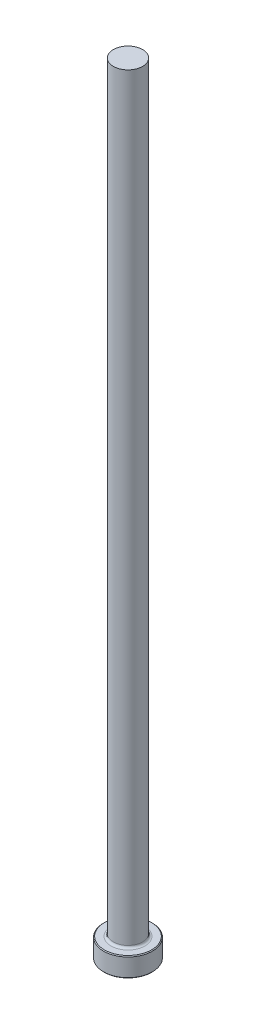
from build123d import *

# Parameters (mm, degrees)
CHAMFER1_SIZE = 0.254
FILLET1_R     = 0.762


with BuildPart() as part:
    # Sketch1 → Revolve1 (revolve)
    with BuildSketch(Plane.XY, mode=Mode.PRIVATE) as revolve1_sk:
        Polygon((0, 0), (-7.9375, 0), (-7.9375, 6.35), (-4.7625, 6.35), (-4.7625, 254), (0, 254), align=None)
    revolve(revolve1_sk.sketch.rotate(Axis((0, 259.958771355, 0), (0, -1, 0)), 270), axis=Axis((0, 259.958771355, 0), (0, -1, 0)))

    # Chamfer1
    chamfer1_edges = [part.edges().sort_by_distance(p)[0] for p in [
        (0, 6.35, -7.9375),
        (0, 0, -7.9375),
    ]]
    chamfer(chamfer1_edges, length=CHAMFER1_SIZE)

    # Fillet1
    fillet1_edges = [part.edges().sort_by_distance(p)[0] for p in [
        (0, 6.35, -4.7625),
    ]]
    fillet(fillet1_edges, radius=FILLET1_R)


solid = part.part
